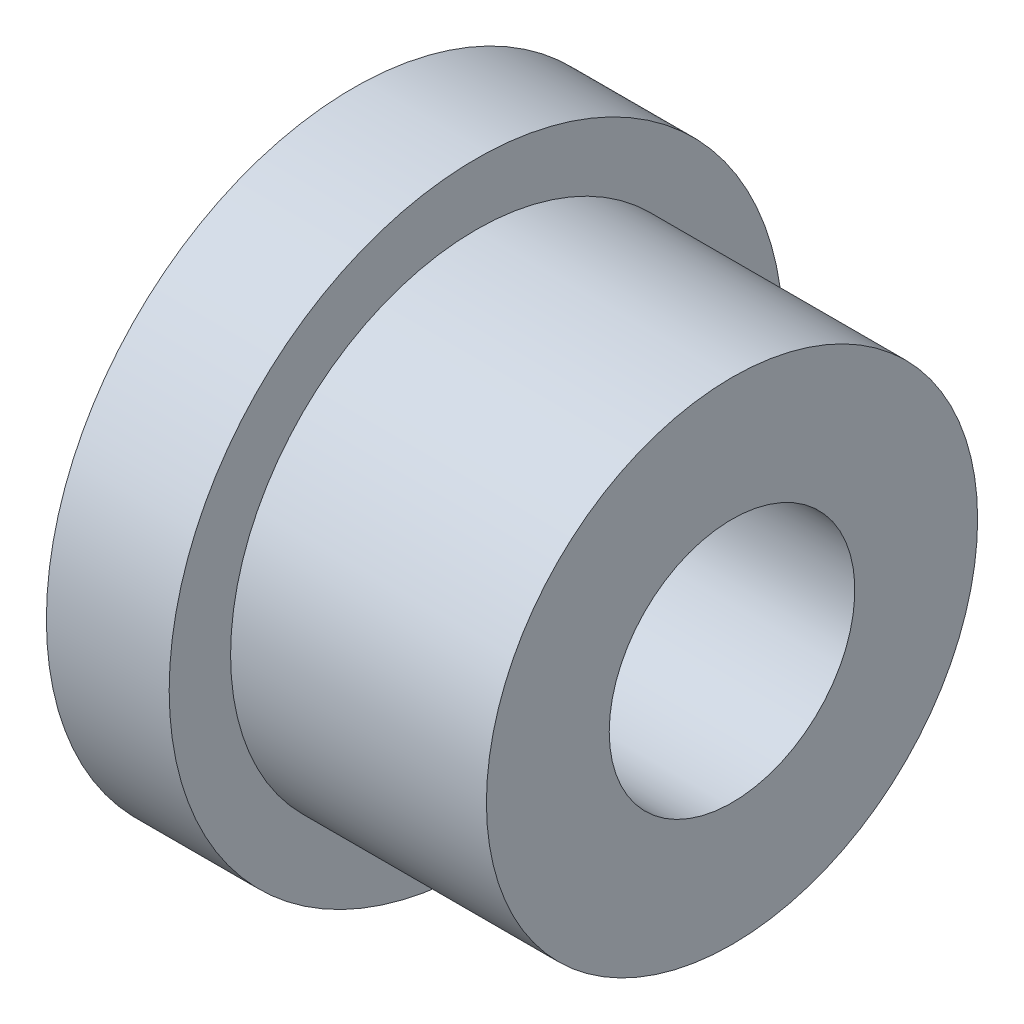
ISO-10303-21;
HEADER;
FILE_DESCRIPTION(('STEP AP214'),'2;1');
FILE_NAME('part.step','',(''),(''),'','','');
FILE_SCHEMA(('AUTOMOTIVE_DESIGN { 1 0 10303 214 1 1 1 1 }'));
ENDSEC;
DATA;
#1=APPLICATION_CONTEXT('core data for automotive mechanical design processes');
#2=APPLICATION_PROTOCOL_DEFINITION('international standard','automotive_design',2000,#1);
#3=PRODUCT_CONTEXT('',#1,'mechanical');
#4=PRODUCT('Part','Part','',(#3));
#5=PRODUCT_RELATED_PRODUCT_CATEGORY('part','',(#4));
#6=PRODUCT_DEFINITION_FORMATION('','',#4);
#7=PRODUCT_DEFINITION_CONTEXT('part definition',#1,'design');
#8=PRODUCT_DEFINITION('design','',#6,#7);
#9=PRODUCT_DEFINITION_SHAPE('','',#8);
#10=(LENGTH_UNIT() NAMED_UNIT(*) SI_UNIT(.MILLI.,.METRE.));
#11=(NAMED_UNIT(*) PLANE_ANGLE_UNIT() SI_UNIT($,.RADIAN.));
#12=(NAMED_UNIT(*) SI_UNIT($,.STERADIAN.) SOLID_ANGLE_UNIT());
#13=UNCERTAINTY_MEASURE_WITH_UNIT(LENGTH_MEASURE(1.E-05),#10,'distance_accuracy_value','');
#14=(GEOMETRIC_REPRESENTATION_CONTEXT(3) GLOBAL_UNCERTAINTY_ASSIGNED_CONTEXT((#13)) GLOBAL_UNIT_ASSIGNED_CONTEXT((#10,
#11,#12)) REPRESENTATION_CONTEXT('',''));
#15=CARTESIAN_POINT('',(0.,0.,0.));
#16=DIRECTION('',(0.,0.,1.));
#17=DIRECTION('',(1.,0.,0.));
#18=AXIS2_PLACEMENT_3D('',#15,#16,#17);
#19=CARTESIAN_POINT('',(-9.5860874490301,0.,0.));
#20=DIRECTION('',(-1.,0.,0.));
#21=DIRECTION('',(0.,0.,1.));
#22=AXIS2_PLACEMENT_3D('',#19,#20,#21);
#23=CYLINDRICAL_SURFACE('',#22,3.);
#24=CARTESIAN_POINT('',(9.25,0.,0.));
#25=DIRECTION('',(-1.,0.,0.));
#26=DIRECTION('',(0.,0.,1.));
#27=AXIS2_PLACEMENT_3D('',#24,#25,#26);
#28=CIRCLE('',#27,3.);
#29=CARTESIAN_POINT('',(9.25,0.,3.));
#30=VERTEX_POINT('',#29);
#31=EDGE_CURVE('E46',#30,#30,#28,.T.);
#32=ORIENTED_EDGE('',*,*,#31,.F.);
#33=EDGE_LOOP('',(#32));
#34=FACE_BOUND('',#33,.T.);
#35=CARTESIAN_POINT('',(0.,0.,0.));
#36=DIRECTION('',(-1.,0.,0.));
#37=DIRECTION('',(0.,0.,1.));
#38=AXIS2_PLACEMENT_3D('',#35,#36,#37);
#39=CIRCLE('',#38,2.99999999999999);
#40=CARTESIAN_POINT('',(0.,0.,2.99999999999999));
#41=VERTEX_POINT('',#40);
#42=EDGE_CURVE('E10',#41,#41,#39,.T.);
#43=ORIENTED_EDGE('',*,*,#42,.T.);
#44=EDGE_LOOP('',(#43));
#45=FACE_BOUND('',#44,.T.);
#46=ADVANCED_FACE('F24',(#34,#45),#23,.F.);
#47=CARTESIAN_POINT('',(0.,2.99999999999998,0.));
#48=DIRECTION('',(1.,0.,0.));
#49=DIRECTION('',(0.,0.,-1.));
#50=AXIS2_PLACEMENT_3D('',#47,#48,#49);
#51=PLANE('',#50);
#52=ORIENTED_EDGE('',*,*,#42,.F.);
#53=EDGE_LOOP('',(#52));
#54=FACE_BOUND('',#53,.T.);
#55=CARTESIAN_POINT('',(0.,0.,0.));
#56=DIRECTION('',(-1.,0.,0.));
#57=DIRECTION('',(0.,0.,1.));
#58=AXIS2_PLACEMENT_3D('',#55,#56,#57);
#59=CIRCLE('',#58,7.5);
#60=CARTESIAN_POINT('',(0.,0.,7.50000000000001));
#61=VERTEX_POINT('',#60);
#62=EDGE_CURVE('E30',#61,#61,#59,.T.);
#63=ORIENTED_EDGE('',*,*,#62,.T.);
#64=EDGE_LOOP('',(#63));
#65=FACE_BOUND('',#64,.T.);
#66=ADVANCED_FACE('F53',(#54,#65),#51,.F.);
#67=CARTESIAN_POINT('',(-9.5860874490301,0.,0.));
#68=DIRECTION('',(-1.,0.,0.));
#69=DIRECTION('',(0.,0.,1.));
#70=AXIS2_PLACEMENT_3D('',#67,#68,#69);
#71=CYLINDRICAL_SURFACE('',#70,7.5);
#72=ORIENTED_EDGE('',*,*,#62,.F.);
#73=EDGE_LOOP('',(#72));
#74=FACE_BOUND('',#73,.T.);
#75=CARTESIAN_POINT('',(3.,0.,0.));
#76=DIRECTION('',(-1.,0.,0.));
#77=DIRECTION('',(0.,0.,1.));
#78=AXIS2_PLACEMENT_3D('',#75,#76,#77);
#79=CIRCLE('',#78,7.5);
#80=CARTESIAN_POINT('',(3.,0.,7.50000000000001));
#81=VERTEX_POINT('',#80);
#82=EDGE_CURVE('E34',#81,#81,#79,.T.);
#83=ORIENTED_EDGE('',*,*,#82,.T.);
#84=EDGE_LOOP('',(#83));
#85=FACE_BOUND('',#84,.T.);
#86=ADVANCED_FACE('F57',(#74,#85),#71,.T.);
#87=CARTESIAN_POINT('',(3.,7.50000000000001,0.));
#88=DIRECTION('',(-1.,0.,0.));
#89=DIRECTION('',(0.,0.,1.));
#90=AXIS2_PLACEMENT_3D('',#87,#88,#89);
#91=PLANE('',#90);
#92=ORIENTED_EDGE('',*,*,#82,.F.);
#93=EDGE_LOOP('',(#92));
#94=FACE_BOUND('',#93,.T.);
#95=CARTESIAN_POINT('',(3.,0.,0.));
#96=DIRECTION('',(-1.,0.,0.));
#97=DIRECTION('',(0.,0.,1.));
#98=AXIS2_PLACEMENT_3D('',#95,#96,#97);
#99=CIRCLE('',#98,6.);
#100=CARTESIAN_POINT('',(3.,0.,6.));
#101=VERTEX_POINT('',#100);
#102=EDGE_CURVE('E38',#101,#101,#99,.T.);
#103=ORIENTED_EDGE('',*,*,#102,.T.);
#104=EDGE_LOOP('',(#103));
#105=FACE_BOUND('',#104,.T.);
#106=ADVANCED_FACE('F62',(#94,#105),#91,.F.);
#107=CARTESIAN_POINT('',(-9.5860874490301,0.,0.));
#108=DIRECTION('',(-1.,0.,0.));
#109=DIRECTION('',(0.,0.,1.));
#110=AXIS2_PLACEMENT_3D('',#107,#108,#109);
#111=CYLINDRICAL_SURFACE('',#110,6.);
#112=ORIENTED_EDGE('',*,*,#102,.F.);
#113=EDGE_LOOP('',(#112));
#114=FACE_BOUND('',#113,.T.);
#115=CARTESIAN_POINT('',(9.25,0.,0.));
#116=DIRECTION('',(-1.,0.,0.));
#117=DIRECTION('',(0.,0.,1.));
#118=AXIS2_PLACEMENT_3D('',#115,#116,#117);
#119=CIRCLE('',#118,6.);
#120=CARTESIAN_POINT('',(9.25,0.,6.));
#121=VERTEX_POINT('',#120);
#122=EDGE_CURVE('E43',#121,#121,#119,.T.);
#123=ORIENTED_EDGE('',*,*,#122,.T.);
#124=EDGE_LOOP('',(#123));
#125=FACE_BOUND('',#124,.T.);
#126=ADVANCED_FACE('F68',(#114,#125),#111,.T.);
#127=CARTESIAN_POINT('',(9.25,6.00000000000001,0.));
#128=DIRECTION('',(-1.,0.,0.));
#129=DIRECTION('',(0.,0.,1.));
#130=AXIS2_PLACEMENT_3D('',#127,#128,#129);
#131=PLANE('',#130);
#132=ORIENTED_EDGE('',*,*,#122,.F.);
#133=EDGE_LOOP('',(#132));
#134=FACE_BOUND('',#133,.T.);
#135=ORIENTED_EDGE('',*,*,#31,.T.);
#136=EDGE_LOOP('',(#135));
#137=FACE_BOUND('',#136,.T.);
#138=ADVANCED_FACE('F50',(#134,#137),#131,.F.);
#139=CLOSED_SHELL('',(#46,#66,#86,#106,#126,#138));
#140=MANIFOLD_SOLID_BREP('B2',#139);
#141=ADVANCED_BREP_SHAPE_REPRESENTATION('',(#18,#140),#14);
#142=SHAPE_DEFINITION_REPRESENTATION(#9,#141);
ENDSEC;
END-ISO-10303-21;
